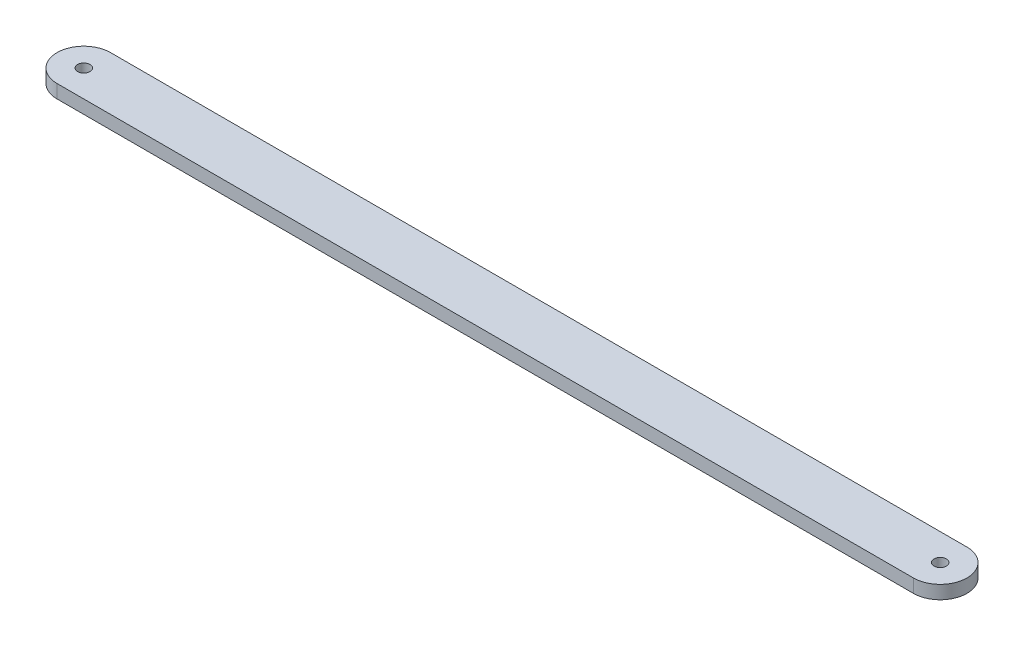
from build123d import *

# Parameters (mm, degrees)
BOSS_EXTRUDE1_DEPTH       = 3.175
F_4_CLEARANCE_HOLE1_D     = 2.9464
F_4_CLEARANCE_HOLE1_DEPTH = 3.302


with BuildPart() as part:
    # Sketch1 → Boss-Extrude1 (new body)
    with BuildSketch(Plane(origin=(0, 0, 0), x_dir=(1, 0, 0), z_dir=(0, 1, 0))):
        with BuildLine():
            Line((0, 6.35), (203.2, 6.35))
            ThreePointArc((203.2, 6.35), (209.55, 0), (203.2, -6.35))
            Line((203.2, -6.35), (0, -6.35))
            ThreePointArc((0, -6.35), (-6.35, 0), (0, 6.35))
        make_face()
    extrude(amount=BOSS_EXTRUDE1_DEPTH)

    # 4 Clearance Hole1
    with Locations(Plane(origin=(0, 3.175, 0), x_dir=(1, 0, 0), z_dir=(0, 1, 0))):
        with Locations((0, 0), (203.2, 0)):
            Hole(F_4_CLEARANCE_HOLE1_D / 2, depth=F_4_CLEARANCE_HOLE1_DEPTH)


solid = part.part
